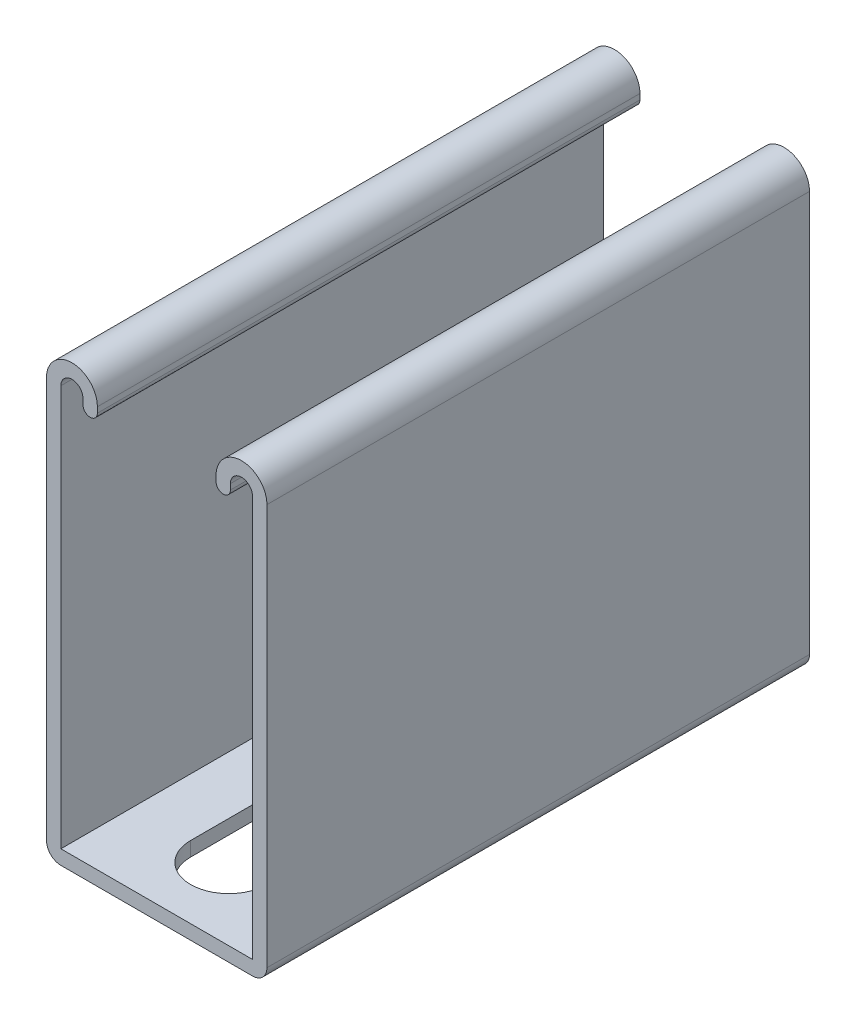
ISO-10303-21;
HEADER;
FILE_DESCRIPTION(('STEP AP214'),'2;1');
FILE_NAME('part.step','',(''),(''),'','','');
FILE_SCHEMA(('AUTOMOTIVE_DESIGN { 1 0 10303 214 1 1 1 1 }'));
ENDSEC;
DATA;
#1=APPLICATION_CONTEXT('core data for automotive mechanical design processes');
#2=APPLICATION_PROTOCOL_DEFINITION('international standard','automotive_design',2000,#1);
#3=PRODUCT_CONTEXT('',#1,'mechanical');
#4=PRODUCT('Part','Part','',(#3));
#5=PRODUCT_RELATED_PRODUCT_CATEGORY('part','',(#4));
#6=PRODUCT_DEFINITION_FORMATION('','',#4);
#7=PRODUCT_DEFINITION_CONTEXT('part definition',#1,'design');
#8=PRODUCT_DEFINITION('design','',#6,#7);
#9=PRODUCT_DEFINITION_SHAPE('','',#8);
#10=(LENGTH_UNIT() NAMED_UNIT(*) SI_UNIT(.MILLI.,.METRE.));
#11=(NAMED_UNIT(*) PLANE_ANGLE_UNIT() SI_UNIT($,.RADIAN.));
#12=(NAMED_UNIT(*) SI_UNIT($,.STERADIAN.) SOLID_ANGLE_UNIT());
#13=UNCERTAINTY_MEASURE_WITH_UNIT(LENGTH_MEASURE(1.E-05),#10,'distance_accuracy_value','');
#14=(GEOMETRIC_REPRESENTATION_CONTEXT(3) GLOBAL_UNCERTAINTY_ASSIGNED_CONTEXT((#13)) GLOBAL_UNIT_ASSIGNED_CONTEXT((#10,
#11,#12)) REPRESENTATION_CONTEXT('',''));
#15=CARTESIAN_POINT('',(0.,0.,0.));
#16=DIRECTION('',(0.,0.,1.));
#17=DIRECTION('',(1.,0.,0.));
#18=AXIS2_PLACEMENT_3D('',#15,#16,#17);
#19=CARTESIAN_POINT('',(-15.875,39.6875,101.6));
#20=DIRECTION('',(0.,0.,-1.));
#21=DIRECTION('',(-1.,0.,0.));
#22=AXIS2_PLACEMENT_3D('',#19,#20,#21);
#23=CYLINDRICAL_SURFACE('',#22,4.7625);
#24=CARTESIAN_POINT('',(-15.875,39.6875,0.));
#25=DIRECTION('',(0.,0.,1.));
#26=DIRECTION('',(-1.,0.,0.));
#27=AXIS2_PLACEMENT_3D('',#24,#25,#26);
#28=CIRCLE('',#27,4.7625);
#29=CARTESIAN_POINT('',(-11.1125,39.6875,0.));
#30=VERTEX_POINT('',#29);
#31=CARTESIAN_POINT('',(-20.6375,39.6875,0.));
#32=VERTEX_POINT('',#31);
#33=EDGE_CURVE('E253',#30,#32,#28,.T.);
#34=ORIENTED_EDGE('',*,*,#33,.T.);
#35=DIRECTION('',(0.,0.,-1.));
#36=VECTOR('',#35,1.);
#37=CARTESIAN_POINT('',(-20.6375,39.6875,101.6));
#38=LINE('',#37,#36);
#39=CARTESIAN_POINT('',(-20.6375,39.6875,101.6));
#40=VERTEX_POINT('',#39);
#41=EDGE_CURVE('E384',#40,#32,#38,.T.);
#42=ORIENTED_EDGE('',*,*,#41,.F.);
#43=CARTESIAN_POINT('',(-15.875,39.6875,101.6));
#44=DIRECTION('',(0.,0.,1.));
#45=DIRECTION('',(-1.,0.,0.));
#46=AXIS2_PLACEMENT_3D('',#43,#44,#45);
#47=CIRCLE('',#46,4.7625);
#48=CARTESIAN_POINT('',(-11.1125,39.6875,101.6));
#49=VERTEX_POINT('',#48);
#50=EDGE_CURVE('E260',#49,#40,#47,.T.);
#51=ORIENTED_EDGE('',*,*,#50,.F.);
#52=DIRECTION('',(0.,0.,-1.));
#53=VECTOR('',#52,1.);
#54=CARTESIAN_POINT('',(-11.1125,39.6875,101.6));
#55=LINE('',#54,#53);
#56=EDGE_CURVE('E298',#49,#30,#55,.T.);
#57=ORIENTED_EDGE('',*,*,#56,.T.);
#58=EDGE_LOOP('',(#34,#42,#51,#57));
#59=FACE_BOUND('',#58,.T.);
#60=ADVANCED_FACE('F32',(#59),#23,.T.);
#61=CARTESIAN_POINT('',(-20.6375,39.6875,101.6));
#62=DIRECTION('',(1.,0.,0.));
#63=DIRECTION('',(0.,1.,0.));
#64=AXIS2_PLACEMENT_3D('',#61,#62,#63);
#65=PLANE('',#64);
#66=DIRECTION('',(0.,-1.,0.));
#67=VECTOR('',#66,1.);
#68=CARTESIAN_POINT('',(-20.6375,39.6875,0.));
#69=LINE('',#68,#67);
#70=CARTESIAN_POINT('',(-20.6375,-35.4076,0.));
#71=VERTEX_POINT('',#70);
#72=EDGE_CURVE('E301',#32,#71,#69,.T.);
#73=ORIENTED_EDGE('',*,*,#72,.T.);
#74=DIRECTION('',(0.,0.,-1.));
#75=VECTOR('',#74,1.);
#76=CARTESIAN_POINT('',(-20.6375,-35.4076,101.6));
#77=LINE('',#76,#75);
#78=CARTESIAN_POINT('',(-20.6375,-35.4076,101.6));
#79=VERTEX_POINT('',#78);
#80=EDGE_CURVE('E381',#79,#71,#77,.T.);
#81=ORIENTED_EDGE('',*,*,#80,.F.);
#82=DIRECTION('',(0.,-1.,0.));
#83=VECTOR('',#82,1.);
#84=CARTESIAN_POINT('',(-20.6375,39.6875,101.6));
#85=LINE('',#84,#83);
#86=EDGE_CURVE('E263',#40,#79,#85,.T.);
#87=ORIENTED_EDGE('',*,*,#86,.F.);
#88=ORIENTED_EDGE('',*,*,#41,.T.);
#89=EDGE_LOOP('',(#73,#81,#87,#88));
#90=FACE_BOUND('',#89,.T.);
#91=ADVANCED_FACE('F425',(#90),#65,.F.);
#92=CARTESIAN_POINT('',(-17.9451,-35.4076,101.6));
#93=DIRECTION('',(0.,0.,-1.));
#94=DIRECTION('',(-1.,0.,0.));
#95=AXIS2_PLACEMENT_3D('',#92,#93,#94);
#96=CYLINDRICAL_SURFACE('',#95,2.6924);
#97=CARTESIAN_POINT('',(-17.9451,-35.4076,0.));
#98=DIRECTION('',(0.,0.,1.));
#99=DIRECTION('',(-1.,0.,0.));
#100=AXIS2_PLACEMENT_3D('',#97,#98,#99);
#101=CIRCLE('',#100,2.6924);
#102=CARTESIAN_POINT('',(-17.9451,-38.1,0.));
#103=VERTEX_POINT('',#102);
#104=EDGE_CURVE('E303',#71,#103,#101,.T.);
#105=ORIENTED_EDGE('',*,*,#104,.T.);
#106=DIRECTION('',(0.,0.,-1.));
#107=VECTOR('',#106,1.);
#108=CARTESIAN_POINT('',(-17.9451,-38.1,101.6));
#109=LINE('',#108,#107);
#110=CARTESIAN_POINT('',(-17.9451,-38.1,101.6));
#111=VERTEX_POINT('',#110);
#112=EDGE_CURVE('E378',#111,#103,#109,.T.);
#113=ORIENTED_EDGE('',*,*,#112,.F.);
#114=CARTESIAN_POINT('',(-17.9451,-35.4076,101.6));
#115=DIRECTION('',(0.,0.,1.));
#116=DIRECTION('',(-1.,0.,0.));
#117=AXIS2_PLACEMENT_3D('',#114,#115,#116);
#118=CIRCLE('',#117,2.6924);
#119=EDGE_CURVE('E266',#79,#111,#118,.T.);
#120=ORIENTED_EDGE('',*,*,#119,.F.);
#121=ORIENTED_EDGE('',*,*,#80,.T.);
#122=EDGE_LOOP('',(#105,#113,#120,#121));
#123=FACE_BOUND('',#122,.T.);
#124=ADVANCED_FACE('F430',(#123),#96,.T.);
#125=CARTESIAN_POINT('',(-17.9451,-38.1,101.6));
#126=DIRECTION('',(0.,1.,0.));
#127=DIRECTION('',(-1.,0.,0.));
#128=AXIS2_PLACEMENT_3D('',#125,#126,#127);
#129=PLANE('',#128);
#130=DIRECTION('',(0.,0.,-1.));
#131=VECTOR('',#130,1.);
#132=CARTESIAN_POINT('',(-7.14375000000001,-38.0999999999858,73.81875));
#133=LINE('',#132,#131);
#134=CARTESIAN_POINT('',(-7.14375000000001,-38.1,88.10625));
#135=VERTEX_POINT('',#134);
#136=CARTESIAN_POINT('',(-7.14375000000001,-38.0999999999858,73.81875));
#137=VERTEX_POINT('',#136);
#138=EDGE_CURVE('E206',#135,#137,#133,.T.);
#139=ORIENTED_EDGE('',*,*,#138,.F.);
#140=CARTESIAN_POINT('',(0.,-38.0999999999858,88.10625));
#141=DIRECTION('',(0.,-1.,0.));
#142=DIRECTION('',(1.,0.,0.));
#143=AXIS2_PLACEMENT_3D('',#140,#141,#142);
#144=CIRCLE('',#143,7.14375);
#145=CARTESIAN_POINT('',(7.14374999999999,-38.0999999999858,88.10625));
#146=VERTEX_POINT('',#145);
#147=EDGE_CURVE('E46',#146,#135,#144,.T.);
#148=ORIENTED_EDGE('',*,*,#147,.F.);
#149=DIRECTION('',(0.,0.,1.));
#150=VECTOR('',#149,1.);
#151=CARTESIAN_POINT('',(7.14374999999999,-38.0999999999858,88.10625));
#152=LINE('',#151,#150);
#153=CARTESIAN_POINT('',(7.14375,-38.0999999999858,73.81875));
#154=VERTEX_POINT('',#153);
#155=EDGE_CURVE('E222',#154,#146,#152,.T.);
#156=ORIENTED_EDGE('',*,*,#155,.F.);
#157=CARTESIAN_POINT('',(0.,-38.0999999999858,73.81875));
#158=DIRECTION('',(0.,-1.,0.));
#159=DIRECTION('',(1.,0.,0.));
#160=AXIS2_PLACEMENT_3D('',#157,#158,#159);
#161=CIRCLE('',#160,7.14375);
#162=EDGE_CURVE('E216',#137,#154,#161,.T.);
#163=ORIENTED_EDGE('',*,*,#162,.F.);
#164=EDGE_LOOP('',(#139,#148,#156,#163));
#165=FACE_BOUND('',#164,.T.);
#166=DIRECTION('',(0.,0.,-1.));
#167=VECTOR('',#166,1.);
#168=CARTESIAN_POINT('',(-7.14375000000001,-38.0999999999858,23.01875));
#169=LINE('',#168,#167);
#170=CARTESIAN_POINT('',(-7.14375000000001,-38.1,37.30625));
#171=VERTEX_POINT('',#170);
#172=CARTESIAN_POINT('',(-7.14375000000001,-38.0999999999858,23.01875));
#173=VERTEX_POINT('',#172);
#174=EDGE_CURVE('E241',#171,#173,#169,.T.);
#175=ORIENTED_EDGE('',*,*,#174,.F.);
#176=CARTESIAN_POINT('',(0.,-38.0999999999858,37.30625));
#177=DIRECTION('',(0.,-1.,0.));
#178=DIRECTION('',(1.,0.,0.));
#179=AXIS2_PLACEMENT_3D('',#176,#177,#178);
#180=CIRCLE('',#179,7.14375);
#181=CARTESIAN_POINT('',(7.14374999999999,-38.0999999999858,37.30625));
#182=VERTEX_POINT('',#181);
#183=EDGE_CURVE('E239',#182,#171,#180,.T.);
#184=ORIENTED_EDGE('',*,*,#183,.F.);
#185=DIRECTION('',(0.,0.,1.));
#186=VECTOR('',#185,1.);
#187=CARTESIAN_POINT('',(7.14374999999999,-38.0999999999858,37.30625));
#188=LINE('',#187,#186);
#189=CARTESIAN_POINT('',(7.14375,-38.0999999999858,23.01875));
#190=VERTEX_POINT('',#189);
#191=EDGE_CURVE('E247',#190,#182,#188,.T.);
#192=ORIENTED_EDGE('',*,*,#191,.F.);
#193=CARTESIAN_POINT('',(0.,-38.0999999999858,23.01875));
#194=DIRECTION('',(0.,-1.,0.));
#195=DIRECTION('',(1.,0.,0.));
#196=AXIS2_PLACEMENT_3D('',#193,#194,#195);
#197=CIRCLE('',#196,7.14375);
#198=EDGE_CURVE('E244',#173,#190,#197,.T.);
#199=ORIENTED_EDGE('',*,*,#198,.F.);
#200=EDGE_LOOP('',(#175,#184,#192,#199));
#201=FACE_BOUND('',#200,.T.);
#202=DIRECTION('',(1.,0.,0.));
#203=VECTOR('',#202,1.);
#204=CARTESIAN_POINT('',(-17.9451,-38.1,0.));
#205=LINE('',#204,#203);
#206=CARTESIAN_POINT('',(17.9451,-38.1,0.));
#207=VERTEX_POINT('',#206);
#208=EDGE_CURVE('E305',#103,#207,#205,.T.);
#209=ORIENTED_EDGE('',*,*,#208,.T.);
#210=DIRECTION('',(0.,0.,-1.));
#211=VECTOR('',#210,1.);
#212=CARTESIAN_POINT('',(17.9451,-38.1,101.6));
#213=LINE('',#212,#211);
#214=CARTESIAN_POINT('',(17.9451,-38.1,101.6));
#215=VERTEX_POINT('',#214);
#216=EDGE_CURVE('E375',#215,#207,#213,.T.);
#217=ORIENTED_EDGE('',*,*,#216,.F.);
#218=DIRECTION('',(1.,0.,0.));
#219=VECTOR('',#218,1.);
#220=CARTESIAN_POINT('',(-17.9451,-38.1,101.6));
#221=LINE('',#220,#219);
#222=EDGE_CURVE('E268',#111,#215,#221,.T.);
#223=ORIENTED_EDGE('',*,*,#222,.F.);
#224=ORIENTED_EDGE('',*,*,#112,.T.);
#225=EDGE_LOOP('',(#209,#217,#223,#224));
#226=FACE_BOUND('',#225,.T.);
#227=ADVANCED_FACE('F220',(#165,#201,#226),#129,.F.);
#228=CARTESIAN_POINT('',(17.9451,-35.4076,101.6));
#229=DIRECTION('',(0.,0.,-1.));
#230=DIRECTION('',(-1.,0.,0.));
#231=AXIS2_PLACEMENT_3D('',#228,#229,#230);
#232=CYLINDRICAL_SURFACE('',#231,2.6924);
#233=CARTESIAN_POINT('',(17.9451,-35.4076,0.));
#234=DIRECTION('',(0.,0.,1.));
#235=DIRECTION('',(1.,0.,0.));
#236=AXIS2_PLACEMENT_3D('',#233,#234,#235);
#237=CIRCLE('',#236,2.6924);
#238=CARTESIAN_POINT('',(20.6375,-35.4076,0.));
#239=VERTEX_POINT('',#238);
#240=EDGE_CURVE('E307',#207,#239,#237,.T.);
#241=ORIENTED_EDGE('',*,*,#240,.T.);
#242=DIRECTION('',(0.,0.,-1.));
#243=VECTOR('',#242,1.);
#244=CARTESIAN_POINT('',(20.6375,-35.4076,101.6));
#245=LINE('',#244,#243);
#246=CARTESIAN_POINT('',(20.6375,-35.4076,101.6));
#247=VERTEX_POINT('',#246);
#248=EDGE_CURVE('E372',#247,#239,#245,.T.);
#249=ORIENTED_EDGE('',*,*,#248,.F.);
#250=CARTESIAN_POINT('',(17.9451,-35.4076,101.6));
#251=DIRECTION('',(0.,0.,1.));
#252=DIRECTION('',(1.,0.,0.));
#253=AXIS2_PLACEMENT_3D('',#250,#251,#252);
#254=CIRCLE('',#253,2.6924);
#255=EDGE_CURVE('E270',#215,#247,#254,.T.);
#256=ORIENTED_EDGE('',*,*,#255,.F.);
#257=ORIENTED_EDGE('',*,*,#216,.T.);
#258=EDGE_LOOP('',(#241,#249,#256,#257));
#259=FACE_BOUND('',#258,.T.);
#260=ADVANCED_FACE('F510',(#259),#232,.T.);
#261=CARTESIAN_POINT('',(20.6375,-35.4076,101.6));
#262=DIRECTION('',(-1.,0.,0.));
#263=DIRECTION('',(0.,-1.,0.));
#264=AXIS2_PLACEMENT_3D('',#261,#262,#263);
#265=PLANE('',#264);
#266=DIRECTION('',(0.,1.,0.));
#267=VECTOR('',#266,1.);
#268=CARTESIAN_POINT('',(20.6375,-35.4076,0.));
#269=LINE('',#268,#267);
#270=CARTESIAN_POINT('',(20.6375,39.6875,0.));
#271=VERTEX_POINT('',#270);
#272=EDGE_CURVE('E309',#239,#271,#269,.T.);
#273=ORIENTED_EDGE('',*,*,#272,.T.);
#274=DIRECTION('',(0.,0.,-1.));
#275=VECTOR('',#274,1.);
#276=CARTESIAN_POINT('',(20.6375,39.6875,101.6));
#277=LINE('',#276,#275);
#278=CARTESIAN_POINT('',(20.6375,39.6875,101.6));
#279=VERTEX_POINT('',#278);
#280=EDGE_CURVE('E369',#279,#271,#277,.T.);
#281=ORIENTED_EDGE('',*,*,#280,.F.);
#282=DIRECTION('',(0.,1.,0.));
#283=VECTOR('',#282,1.);
#284=CARTESIAN_POINT('',(20.6375,-35.4076,101.6));
#285=LINE('',#284,#283);
#286=EDGE_CURVE('E272',#247,#279,#285,.T.);
#287=ORIENTED_EDGE('',*,*,#286,.F.);
#288=ORIENTED_EDGE('',*,*,#248,.T.);
#289=EDGE_LOOP('',(#273,#281,#287,#288));
#290=FACE_BOUND('',#289,.T.);
#291=ADVANCED_FACE('F506',(#290),#265,.F.);
#292=CARTESIAN_POINT('',(15.875,39.6875,101.6));
#293=DIRECTION('',(0.,0.,-1.));
#294=DIRECTION('',(-1.,0.,0.));
#295=AXIS2_PLACEMENT_3D('',#292,#293,#294);
#296=CYLINDRICAL_SURFACE('',#295,4.7625);
#297=CARTESIAN_POINT('',(15.875,39.6875,0.));
#298=DIRECTION('',(0.,0.,1.));
#299=DIRECTION('',(1.,0.,0.));
#300=AXIS2_PLACEMENT_3D('',#297,#298,#299);
#301=CIRCLE('',#300,4.7625);
#302=CARTESIAN_POINT('',(11.1125,39.6875,0.));
#303=VERTEX_POINT('',#302);
#304=EDGE_CURVE('E311',#271,#303,#301,.T.);
#305=ORIENTED_EDGE('',*,*,#304,.T.);
#306=DIRECTION('',(0.,0.,-1.));
#307=VECTOR('',#306,1.);
#308=CARTESIAN_POINT('',(11.1125,39.6875,101.6));
#309=LINE('',#308,#307);
#310=CARTESIAN_POINT('',(11.1125,39.6875,101.6));
#311=VERTEX_POINT('',#310);
#312=EDGE_CURVE('E366',#311,#303,#309,.T.);
#313=ORIENTED_EDGE('',*,*,#312,.F.);
#314=CARTESIAN_POINT('',(15.875,39.6875,101.6));
#315=DIRECTION('',(0.,0.,1.));
#316=DIRECTION('',(1.,0.,0.));
#317=AXIS2_PLACEMENT_3D('',#314,#315,#316);
#318=CIRCLE('',#317,4.7625);
#319=EDGE_CURVE('E274',#279,#311,#318,.T.);
#320=ORIENTED_EDGE('',*,*,#319,.F.);
#321=ORIENTED_EDGE('',*,*,#280,.T.);
#322=EDGE_LOOP('',(#305,#313,#320,#321));
#323=FACE_BOUND('',#322,.T.);
#324=ADVANCED_FACE('F501',(#323),#296,.T.);
#325=CARTESIAN_POINT('',(11.1125,39.6875,101.6));
#326=DIRECTION('',(1.,0.,0.));
#327=DIRECTION('',(0.,1.,0.));
#328=AXIS2_PLACEMENT_3D('',#325,#326,#327);
#329=PLANE('',#328);
#330=DIRECTION('',(0.,-1.,0.));
#331=VECTOR('',#330,1.);
#332=CARTESIAN_POINT('',(11.1125,39.6875,0.));
#333=LINE('',#332,#331);
#334=CARTESIAN_POINT('',(11.1125,38.65245,0.));
#335=VERTEX_POINT('',#334);
#336=EDGE_CURVE('E313',#303,#335,#333,.T.);
#337=ORIENTED_EDGE('',*,*,#336,.T.);
#338=DIRECTION('',(0.,0.,-1.));
#339=VECTOR('',#338,1.);
#340=CARTESIAN_POINT('',(11.1125,38.65245,101.6));
#341=LINE('',#340,#339);
#342=CARTESIAN_POINT('',(11.1125,38.65245,101.6));
#343=VERTEX_POINT('',#342);
#344=EDGE_CURVE('E363',#343,#335,#341,.T.);
#345=ORIENTED_EDGE('',*,*,#344,.F.);
#346=DIRECTION('',(0.,-1.,0.));
#347=VECTOR('',#346,1.);
#348=CARTESIAN_POINT('',(11.1125,39.6875,101.6));
#349=LINE('',#348,#347);
#350=EDGE_CURVE('E276',#311,#343,#349,.T.);
#351=ORIENTED_EDGE('',*,*,#350,.F.);
#352=ORIENTED_EDGE('',*,*,#312,.T.);
#353=EDGE_LOOP('',(#337,#345,#351,#352));
#354=FACE_BOUND('',#353,.T.);
#355=ADVANCED_FACE('F495',(#354),#329,.F.);
#356=CARTESIAN_POINT('',(12.4587,38.65245,101.6));
#357=DIRECTION('',(0.,0.,-1.));
#358=DIRECTION('',(-1.,0.,0.));
#359=AXIS2_PLACEMENT_3D('',#356,#357,#358);
#360=CYLINDRICAL_SURFACE('',#359,1.3462);
#361=CARTESIAN_POINT('',(12.4587,38.65245,0.));
#362=DIRECTION('',(0.,0.,1.));
#363=DIRECTION('',(1.,0.,0.));
#364=AXIS2_PLACEMENT_3D('',#361,#362,#363);
#365=CIRCLE('',#364,1.3462);
#366=CARTESIAN_POINT('',(13.8049,38.65245,0.));
#367=VERTEX_POINT('',#366);
#368=EDGE_CURVE('E315',#335,#367,#365,.T.);
#369=ORIENTED_EDGE('',*,*,#368,.T.);
#370=DIRECTION('',(0.,0.,-1.));
#371=VECTOR('',#370,1.);
#372=CARTESIAN_POINT('',(13.8049,38.65245,101.6));
#373=LINE('',#372,#371);
#374=CARTESIAN_POINT('',(13.8049,38.65245,101.6));
#375=VERTEX_POINT('',#374);
#376=EDGE_CURVE('E360',#375,#367,#373,.T.);
#377=ORIENTED_EDGE('',*,*,#376,.F.);
#378=CARTESIAN_POINT('',(12.4587,38.65245,101.6));
#379=DIRECTION('',(0.,0.,1.));
#380=DIRECTION('',(1.,0.,0.));
#381=AXIS2_PLACEMENT_3D('',#378,#379,#380);
#382=CIRCLE('',#381,1.3462);
#383=EDGE_CURVE('E278',#343,#375,#382,.T.);
#384=ORIENTED_EDGE('',*,*,#383,.F.);
#385=ORIENTED_EDGE('',*,*,#344,.T.);
#386=EDGE_LOOP('',(#369,#377,#384,#385));
#387=FACE_BOUND('',#386,.T.);
#388=ADVANCED_FACE('F491',(#387),#360,.T.);
#389=CARTESIAN_POINT('',(13.8049,39.6875,101.6));
#390=DIRECTION('',(-1.,0.,0.));
#391=DIRECTION('',(0.,0.,1.));
#392=AXIS2_PLACEMENT_3D('',#389,#390,#391);
#393=PLANE('',#392);
#394=DIRECTION('',(0.,1.,0.));
#395=VECTOR('',#394,1.);
#396=CARTESIAN_POINT('',(13.8049,39.6875,0.));
#397=LINE('',#396,#395);
#398=CARTESIAN_POINT('',(13.8049,39.6875,0.));
#399=VERTEX_POINT('',#398);
#400=EDGE_CURVE('E317',#367,#399,#397,.T.);
#401=ORIENTED_EDGE('',*,*,#400,.T.);
#402=DIRECTION('',(0.,0.,-1.));
#403=VECTOR('',#402,1.);
#404=CARTESIAN_POINT('',(13.8049,39.6875,101.6));
#405=LINE('',#404,#403);
#406=CARTESIAN_POINT('',(13.8049,39.6875,101.6));
#407=VERTEX_POINT('',#406);
#408=EDGE_CURVE('E357',#407,#399,#405,.T.);
#409=ORIENTED_EDGE('',*,*,#408,.F.);
#410=DIRECTION('',(0.,1.,0.));
#411=VECTOR('',#410,1.);
#412=CARTESIAN_POINT('',(13.8049,39.6875,101.6));
#413=LINE('',#412,#411);
#414=EDGE_CURVE('E280',#375,#407,#413,.T.);
#415=ORIENTED_EDGE('',*,*,#414,.F.);
#416=ORIENTED_EDGE('',*,*,#376,.T.);
#417=EDGE_LOOP('',(#401,#409,#415,#416));
#418=FACE_BOUND('',#417,.T.);
#419=ADVANCED_FACE('F486',(#418),#393,.F.);
#420=CARTESIAN_POINT('',(15.875,39.6875,101.6));
#421=DIRECTION('',(0.,0.,-1.));
#422=DIRECTION('',(-1.,0.,0.));
#423=AXIS2_PLACEMENT_3D('',#420,#421,#422);
#424=CYLINDRICAL_SURFACE('',#423,2.07010000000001);
#425=CARTESIAN_POINT('',(15.875,39.6875,0.));
#426=DIRECTION('',(0.,0.,-1.));
#427=DIRECTION('',(1.,0.,0.));
#428=AXIS2_PLACEMENT_3D('',#425,#426,#427);
#429=CIRCLE('',#428,2.07010000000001);
#430=CARTESIAN_POINT('',(17.9451,39.6875,0.));
#431=VERTEX_POINT('',#430);
#432=EDGE_CURVE('E319',#399,#431,#429,.T.);
#433=ORIENTED_EDGE('',*,*,#432,.T.);
#434=DIRECTION('',(0.,0.,-1.));
#435=VECTOR('',#434,1.);
#436=CARTESIAN_POINT('',(17.9451,39.6875,101.6));
#437=LINE('',#436,#435);
#438=CARTESIAN_POINT('',(17.9451,39.6875,101.6));
#439=VERTEX_POINT('',#438);
#440=EDGE_CURVE('E354',#439,#431,#437,.T.);
#441=ORIENTED_EDGE('',*,*,#440,.F.);
#442=CARTESIAN_POINT('',(15.875,39.6875,101.6));
#443=DIRECTION('',(0.,0.,-1.));
#444=DIRECTION('',(1.,0.,0.));
#445=AXIS2_PLACEMENT_3D('',#442,#443,#444);
#446=CIRCLE('',#445,2.07010000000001);
#447=EDGE_CURVE('E282',#407,#439,#446,.T.);
#448=ORIENTED_EDGE('',*,*,#447,.F.);
#449=ORIENTED_EDGE('',*,*,#408,.T.);
#450=EDGE_LOOP('',(#433,#441,#448,#449));
#451=FACE_BOUND('',#450,.T.);
#452=ADVANCED_FACE('F480',(#451),#424,.F.);
#453=CARTESIAN_POINT('',(17.9451,-35.4076,101.6));
#454=DIRECTION('',(1.,0.,0.));
#455=DIRECTION('',(0.,0.,-1.));
#456=AXIS2_PLACEMENT_3D('',#453,#454,#455);
#457=PLANE('',#456);
#458=DIRECTION('',(0.,-1.,0.));
#459=VECTOR('',#458,1.);
#460=CARTESIAN_POINT('',(17.9451,-35.4076,0.));
#461=LINE('',#460,#459);
#462=CARTESIAN_POINT('',(17.9451,-35.4076,0.));
#463=VERTEX_POINT('',#462);
#464=EDGE_CURVE('E321',#431,#463,#461,.T.);
#465=ORIENTED_EDGE('',*,*,#464,.T.);
#466=DIRECTION('',(0.,0.,-1.));
#467=VECTOR('',#466,1.);
#468=CARTESIAN_POINT('',(17.9451,-35.4076,101.6));
#469=LINE('',#468,#467);
#470=CARTESIAN_POINT('',(17.9451,-35.4076,101.6));
#471=VERTEX_POINT('',#470);
#472=EDGE_CURVE('E351',#471,#463,#469,.T.);
#473=ORIENTED_EDGE('',*,*,#472,.F.);
#474=DIRECTION('',(0.,-1.,0.));
#475=VECTOR('',#474,1.);
#476=CARTESIAN_POINT('',(17.9451,-35.4076,101.6));
#477=LINE('',#476,#475);
#478=EDGE_CURVE('E284',#439,#471,#477,.T.);
#479=ORIENTED_EDGE('',*,*,#478,.F.);
#480=ORIENTED_EDGE('',*,*,#440,.T.);
#481=EDGE_LOOP('',(#465,#473,#479,#480));
#482=FACE_BOUND('',#481,.T.);
#483=ADVANCED_FACE('F476',(#482),#457,.F.);
#484=CARTESIAN_POINT('',(-17.9451,-35.4076,101.6));
#485=DIRECTION('',(0.,-1.,0.));
#486=DIRECTION('',(0.,0.,-1.));
#487=AXIS2_PLACEMENT_3D('',#484,#485,#486);
#488=PLANE('',#487);
#489=DIRECTION('',(0.,0.,1.));
#490=VECTOR('',#489,1.);
#491=CARTESIAN_POINT('',(7.14374999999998,-35.4076,152.4));
#492=LINE('',#491,#490);
#493=CARTESIAN_POINT('',(7.14375,-35.4076,73.81875));
#494=VERTEX_POINT('',#493);
#495=CARTESIAN_POINT('',(7.14374999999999,-35.4076,88.10625));
#496=VERTEX_POINT('',#495);
#497=EDGE_CURVE('E232',#494,#496,#492,.T.);
#498=ORIENTED_EDGE('',*,*,#497,.T.);
#499=CARTESIAN_POINT('',(0.,-35.4076,88.10625));
#500=DIRECTION('',(0.,-1.,0.));
#501=DIRECTION('',(0.,0.,-1.));
#502=AXIS2_PLACEMENT_3D('',#499,#500,#501);
#503=CIRCLE('',#502,7.14375);
#504=CARTESIAN_POINT('',(-7.14375000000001,-35.4076,88.10625));
#505=VERTEX_POINT('',#504);
#506=EDGE_CURVE('E236',#496,#505,#503,.T.);
#507=ORIENTED_EDGE('',*,*,#506,.T.);
#508=DIRECTION('',(0.,0.,-1.));
#509=VECTOR('',#508,1.);
#510=CARTESIAN_POINT('',(-7.14375000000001,-35.4076,152.4));
#511=LINE('',#510,#509);
#512=CARTESIAN_POINT('',(-7.14375000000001,-35.4076,73.81875));
#513=VERTEX_POINT('',#512);
#514=EDGE_CURVE('E213',#505,#513,#511,.T.);
#515=ORIENTED_EDGE('',*,*,#514,.T.);
#516=CARTESIAN_POINT('',(0.,-35.4076,73.81875));
#517=DIRECTION('',(0.,-1.,0.));
#518=DIRECTION('',(0.,0.,-1.));
#519=AXIS2_PLACEMENT_3D('',#516,#517,#518);
#520=CIRCLE('',#519,7.14375);
#521=EDGE_CURVE('E54',#513,#494,#520,.T.);
#522=ORIENTED_EDGE('',*,*,#521,.T.);
#523=EDGE_LOOP('',(#498,#507,#515,#522));
#524=FACE_BOUND('',#523,.T.);
#525=DIRECTION('',(0.,0.,1.));
#526=VECTOR('',#525,1.);
#527=CARTESIAN_POINT('',(7.14374999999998,-35.4076,101.6));
#528=LINE('',#527,#526);
#529=CARTESIAN_POINT('',(7.14375,-35.4076,23.01875));
#530=VERTEX_POINT('',#529);
#531=CARTESIAN_POINT('',(7.14374999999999,-35.4076,37.30625));
#532=VERTEX_POINT('',#531);
#533=EDGE_CURVE('E39',#530,#532,#528,.T.);
#534=ORIENTED_EDGE('',*,*,#533,.T.);
#535=CARTESIAN_POINT('',(0.,-35.4076,37.30625));
#536=DIRECTION('',(0.,-1.,0.));
#537=DIRECTION('',(0.,0.,-1.));
#538=AXIS2_PLACEMENT_3D('',#535,#536,#537);
#539=CIRCLE('',#538,7.14375);
#540=CARTESIAN_POINT('',(-7.14375000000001,-35.4076,37.30625));
#541=VERTEX_POINT('',#540);
#542=EDGE_CURVE('E11',#532,#541,#539,.T.);
#543=ORIENTED_EDGE('',*,*,#542,.T.);
#544=DIRECTION('',(0.,0.,-1.));
#545=VECTOR('',#544,1.);
#546=CARTESIAN_POINT('',(-7.14375000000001,-35.4076,101.6));
#547=LINE('',#546,#545);
#548=CARTESIAN_POINT('',(-7.14375000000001,-35.4076,23.01875));
#549=VERTEX_POINT('',#548);
#550=EDGE_CURVE('E387',#541,#549,#547,.T.);
#551=ORIENTED_EDGE('',*,*,#550,.T.);
#552=CARTESIAN_POINT('',(0.,-35.4076,23.01875));
#553=DIRECTION('',(0.,-1.,0.));
#554=DIRECTION('',(0.,0.,-1.));
#555=AXIS2_PLACEMENT_3D('',#552,#553,#554);
#556=CIRCLE('',#555,7.14375);
#557=EDGE_CURVE('E390',#549,#530,#556,.T.);
#558=ORIENTED_EDGE('',*,*,#557,.T.);
#559=EDGE_LOOP('',(#534,#543,#551,#558));
#560=FACE_BOUND('',#559,.T.);
#561=DIRECTION('',(-1.,0.,0.));
#562=VECTOR('',#561,1.);
#563=CARTESIAN_POINT('',(-17.9451,-35.4076,0.));
#564=LINE('',#563,#562);
#565=CARTESIAN_POINT('',(-17.9451,-35.4076,0.));
#566=VERTEX_POINT('',#565);
#567=EDGE_CURVE('E323',#463,#566,#564,.T.);
#568=ORIENTED_EDGE('',*,*,#567,.T.);
#569=DIRECTION('',(0.,0.,-1.));
#570=VECTOR('',#569,1.);
#571=CARTESIAN_POINT('',(-17.9451,-35.4076,101.6));
#572=LINE('',#571,#570);
#573=CARTESIAN_POINT('',(-17.9451,-35.4076,101.6));
#574=VERTEX_POINT('',#573);
#575=EDGE_CURVE('E348',#574,#566,#572,.T.);
#576=ORIENTED_EDGE('',*,*,#575,.F.);
#577=DIRECTION('',(-1.,0.,0.));
#578=VECTOR('',#577,1.);
#579=CARTESIAN_POINT('',(-17.9451,-35.4076,101.6));
#580=LINE('',#579,#578);
#581=EDGE_CURVE('E286',#471,#574,#580,.T.);
#582=ORIENTED_EDGE('',*,*,#581,.F.);
#583=ORIENTED_EDGE('',*,*,#472,.T.);
#584=EDGE_LOOP('',(#568,#576,#582,#583));
#585=FACE_BOUND('',#584,.T.);
#586=ADVANCED_FACE('F394',(#524,#560,#585),#488,.F.);
#587=CARTESIAN_POINT('',(-17.9451,39.6875,101.6));
#588=DIRECTION('',(-1.,0.,0.));
#589=DIRECTION('',(0.,-1.,0.));
#590=AXIS2_PLACEMENT_3D('',#587,#588,#589);
#591=PLANE('',#590);
#592=DIRECTION('',(0.,1.,0.));
#593=VECTOR('',#592,1.);
#594=CARTESIAN_POINT('',(-17.9451,39.6875,0.));
#595=LINE('',#594,#593);
#596=CARTESIAN_POINT('',(-17.9451,39.6875,0.));
#597=VERTEX_POINT('',#596);
#598=EDGE_CURVE('E325',#566,#597,#595,.T.);
#599=ORIENTED_EDGE('',*,*,#598,.T.);
#600=DIRECTION('',(0.,0.,-1.));
#601=VECTOR('',#600,1.);
#602=CARTESIAN_POINT('',(-17.9451,39.6875,101.6));
#603=LINE('',#602,#601);
#604=CARTESIAN_POINT('',(-17.9451,39.6875,101.6));
#605=VERTEX_POINT('',#604);
#606=EDGE_CURVE('E345',#605,#597,#603,.T.);
#607=ORIENTED_EDGE('',*,*,#606,.F.);
#608=DIRECTION('',(0.,1.,0.));
#609=VECTOR('',#608,1.);
#610=CARTESIAN_POINT('',(-17.9451,39.6875,101.6));
#611=LINE('',#610,#609);
#612=EDGE_CURVE('E288',#574,#605,#611,.T.);
#613=ORIENTED_EDGE('',*,*,#612,.F.);
#614=ORIENTED_EDGE('',*,*,#575,.T.);
#615=EDGE_LOOP('',(#599,#607,#613,#614));
#616=FACE_BOUND('',#615,.T.);
#617=ADVANCED_FACE('F467',(#616),#591,.F.);
#618=CARTESIAN_POINT('',(-15.875,39.6875,101.6));
#619=DIRECTION('',(0.,0.,-1.));
#620=DIRECTION('',(-1.,0.,0.));
#621=AXIS2_PLACEMENT_3D('',#618,#619,#620);
#622=CYLINDRICAL_SURFACE('',#621,2.0701);
#623=CARTESIAN_POINT('',(-15.875,39.6875,0.));
#624=DIRECTION('',(0.,0.,-1.));
#625=DIRECTION('',(-1.,0.,0.));
#626=AXIS2_PLACEMENT_3D('',#623,#624,#625);
#627=CIRCLE('',#626,2.0701);
#628=CARTESIAN_POINT('',(-13.8049,39.6875,0.));
#629=VERTEX_POINT('',#628);
#630=EDGE_CURVE('E327',#597,#629,#627,.T.);
#631=ORIENTED_EDGE('',*,*,#630,.T.);
#632=DIRECTION('',(0.,0.,-1.));
#633=VECTOR('',#632,1.);
#634=CARTESIAN_POINT('',(-13.8049,39.6875,101.6));
#635=LINE('',#634,#633);
#636=CARTESIAN_POINT('',(-13.8049,39.6875,101.6));
#637=VERTEX_POINT('',#636);
#638=EDGE_CURVE('E342',#637,#629,#635,.T.);
#639=ORIENTED_EDGE('',*,*,#638,.F.);
#640=CARTESIAN_POINT('',(-15.875,39.6875,101.6));
#641=DIRECTION('',(0.,0.,-1.));
#642=DIRECTION('',(-1.,0.,0.));
#643=AXIS2_PLACEMENT_3D('',#640,#641,#642);
#644=CIRCLE('',#643,2.0701);
#645=EDGE_CURVE('E290',#605,#637,#644,.T.);
#646=ORIENTED_EDGE('',*,*,#645,.F.);
#647=ORIENTED_EDGE('',*,*,#606,.T.);
#648=EDGE_LOOP('',(#631,#639,#646,#647));
#649=FACE_BOUND('',#648,.T.);
#650=ADVANCED_FACE('F463',(#649),#622,.F.);
#651=CARTESIAN_POINT('',(-13.8049,39.6875,101.6));
#652=DIRECTION('',(1.,0.,0.));
#653=DIRECTION('',(0.,1.,0.));
#654=AXIS2_PLACEMENT_3D('',#651,#652,#653);
#655=PLANE('',#654);
#656=DIRECTION('',(0.,-1.,0.));
#657=VECTOR('',#656,1.);
#658=CARTESIAN_POINT('',(-13.8049,39.6875,0.));
#659=LINE('',#658,#657);
#660=CARTESIAN_POINT('',(-13.8049,38.65245,0.));
#661=VERTEX_POINT('',#660);
#662=EDGE_CURVE('E329',#629,#661,#659,.T.);
#663=ORIENTED_EDGE('',*,*,#662,.T.);
#664=DIRECTION('',(0.,0.,-1.));
#665=VECTOR('',#664,1.);
#666=CARTESIAN_POINT('',(-13.8049,38.65245,101.6));
#667=LINE('',#666,#665);
#668=CARTESIAN_POINT('',(-13.8049,38.65245,101.6));
#669=VERTEX_POINT('',#668);
#670=EDGE_CURVE('E339',#669,#661,#667,.T.);
#671=ORIENTED_EDGE('',*,*,#670,.F.);
#672=DIRECTION('',(0.,-1.,0.));
#673=VECTOR('',#672,1.);
#674=CARTESIAN_POINT('',(-13.8049,39.6875,101.6));
#675=LINE('',#674,#673);
#676=EDGE_CURVE('E292',#637,#669,#675,.T.);
#677=ORIENTED_EDGE('',*,*,#676,.F.);
#678=ORIENTED_EDGE('',*,*,#638,.T.);
#679=EDGE_LOOP('',(#663,#671,#677,#678));
#680=FACE_BOUND('',#679,.T.);
#681=ADVANCED_FACE('F458',(#680),#655,.F.);
#682=CARTESIAN_POINT('',(-12.4587,38.65245,101.6));
#683=DIRECTION('',(0.,0.,-1.));
#684=DIRECTION('',(-1.,0.,0.));
#685=AXIS2_PLACEMENT_3D('',#682,#683,#684);
#686=CYLINDRICAL_SURFACE('',#685,1.3462);
#687=CARTESIAN_POINT('',(-12.4587,38.65245,0.));
#688=DIRECTION('',(0.,0.,1.));
#689=DIRECTION('',(-1.,0.,0.));
#690=AXIS2_PLACEMENT_3D('',#687,#688,#689);
#691=CIRCLE('',#690,1.3462);
#692=CARTESIAN_POINT('',(-11.1125,38.65245,0.));
#693=VERTEX_POINT('',#692);
#694=EDGE_CURVE('E331',#661,#693,#691,.T.);
#695=ORIENTED_EDGE('',*,*,#694,.T.);
#696=DIRECTION('',(0.,0.,-1.));
#697=VECTOR('',#696,1.);
#698=CARTESIAN_POINT('',(-11.1125,38.65245,101.6));
#699=LINE('',#698,#697);
#700=CARTESIAN_POINT('',(-11.1125,38.65245,101.6));
#701=VERTEX_POINT('',#700);
#702=EDGE_CURVE('E336',#701,#693,#699,.T.);
#703=ORIENTED_EDGE('',*,*,#702,.F.);
#704=CARTESIAN_POINT('',(-12.4587,38.65245,101.6));
#705=DIRECTION('',(0.,0.,1.));
#706=DIRECTION('',(-1.,0.,0.));
#707=AXIS2_PLACEMENT_3D('',#704,#705,#706);
#708=CIRCLE('',#707,1.3462);
#709=EDGE_CURVE('E294',#669,#701,#708,.T.);
#710=ORIENTED_EDGE('',*,*,#709,.F.);
#711=ORIENTED_EDGE('',*,*,#670,.T.);
#712=EDGE_LOOP('',(#695,#703,#710,#711));
#713=FACE_BOUND('',#712,.T.);
#714=ADVANCED_FACE('F452',(#713),#686,.T.);
#715=CARTESIAN_POINT('',(-11.1125,39.6875,101.6));
#716=DIRECTION('',(-1.,0.,0.));
#717=DIRECTION('',(0.,-1.,0.));
#718=AXIS2_PLACEMENT_3D('',#715,#716,#717);
#719=PLANE('',#718);
#720=DIRECTION('',(0.,1.,0.));
#721=VECTOR('',#720,1.);
#722=CARTESIAN_POINT('',(-11.1125,39.6875,0.));
#723=LINE('',#722,#721);
#724=EDGE_CURVE('E264',#693,#30,#723,.T.);
#725=ORIENTED_EDGE('',*,*,#724,.T.);
#726=ORIENTED_EDGE('',*,*,#56,.F.);
#727=DIRECTION('',(0.,1.,0.));
#728=VECTOR('',#727,1.);
#729=CARTESIAN_POINT('',(-11.1125,39.6875,101.6));
#730=LINE('',#729,#728);
#731=EDGE_CURVE('E296',#701,#49,#730,.T.);
#732=ORIENTED_EDGE('',*,*,#731,.F.);
#733=ORIENTED_EDGE('',*,*,#702,.T.);
#734=EDGE_LOOP('',(#725,#726,#732,#733));
#735=FACE_BOUND('',#734,.T.);
#736=ADVANCED_FACE('F450',(#735),#719,.F.);
#737=CARTESIAN_POINT('',(-15.875,39.6875,101.6));
#738=DIRECTION('',(0.,0.,-1.));
#739=DIRECTION('',(-1.,0.,0.));
#740=AXIS2_PLACEMENT_3D('',#737,#738,#739);
#741=PLANE('',#740);
#742=ORIENTED_EDGE('',*,*,#50,.T.);
#743=ORIENTED_EDGE('',*,*,#86,.T.);
#744=ORIENTED_EDGE('',*,*,#119,.T.);
#745=ORIENTED_EDGE('',*,*,#222,.T.);
#746=ORIENTED_EDGE('',*,*,#255,.T.);
#747=ORIENTED_EDGE('',*,*,#286,.T.);
#748=ORIENTED_EDGE('',*,*,#319,.T.);
#749=ORIENTED_EDGE('',*,*,#350,.T.);
#750=ORIENTED_EDGE('',*,*,#383,.T.);
#751=ORIENTED_EDGE('',*,*,#414,.T.);
#752=ORIENTED_EDGE('',*,*,#447,.T.);
#753=ORIENTED_EDGE('',*,*,#478,.T.);
#754=ORIENTED_EDGE('',*,*,#581,.T.);
#755=ORIENTED_EDGE('',*,*,#612,.T.);
#756=ORIENTED_EDGE('',*,*,#645,.T.);
#757=ORIENTED_EDGE('',*,*,#676,.T.);
#758=ORIENTED_EDGE('',*,*,#709,.T.);
#759=ORIENTED_EDGE('',*,*,#731,.T.);
#760=EDGE_LOOP('',(#742,#743,#744,#745,#746,#747,#748,#749,#750,#751,#752,#753,#754,#755,#756,
#757,#758,#759));
#761=FACE_BOUND('',#760,.T.);
#762=ADVANCED_FACE('F445',(#761),#741,.F.);
#763=CARTESIAN_POINT('',(-15.875,39.6875,0.));
#764=DIRECTION('',(0.,0.,-1.));
#765=DIRECTION('',(-1.,0.,0.));
#766=AXIS2_PLACEMENT_3D('',#763,#764,#765);
#767=PLANE('',#766);
#768=ORIENTED_EDGE('',*,*,#33,.F.);
#769=ORIENTED_EDGE('',*,*,#724,.F.);
#770=ORIENTED_EDGE('',*,*,#694,.F.);
#771=ORIENTED_EDGE('',*,*,#662,.F.);
#772=ORIENTED_EDGE('',*,*,#630,.F.);
#773=ORIENTED_EDGE('',*,*,#598,.F.);
#774=ORIENTED_EDGE('',*,*,#567,.F.);
#775=ORIENTED_EDGE('',*,*,#464,.F.);
#776=ORIENTED_EDGE('',*,*,#432,.F.);
#777=ORIENTED_EDGE('',*,*,#400,.F.);
#778=ORIENTED_EDGE('',*,*,#368,.F.);
#779=ORIENTED_EDGE('',*,*,#336,.F.);
#780=ORIENTED_EDGE('',*,*,#304,.F.);
#781=ORIENTED_EDGE('',*,*,#272,.F.);
#782=ORIENTED_EDGE('',*,*,#240,.F.);
#783=ORIENTED_EDGE('',*,*,#208,.F.);
#784=ORIENTED_EDGE('',*,*,#104,.F.);
#785=ORIENTED_EDGE('',*,*,#72,.F.);
#786=EDGE_LOOP('',(#768,#769,#770,#771,#772,#773,#774,#775,#776,#777,#778,#779,#780,#781,#782,
#783,#784,#785));
#787=FACE_BOUND('',#786,.T.);
#788=ADVANCED_FACE('F438',(#787),#767,.T.);
#789=CARTESIAN_POINT('',(0.,44.45,37.30625));
#790=DIRECTION('',(0.,-1.,0.));
#791=DIRECTION('',(1.,0.,0.));
#792=AXIS2_PLACEMENT_3D('',#789,#790,#791);
#793=CYLINDRICAL_SURFACE('',#792,7.14375);
#794=DIRECTION('',(0.,-1.,0.));
#795=VECTOR('',#794,1.);
#796=CARTESIAN_POINT('',(7.14375000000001,44.45,37.30625));
#797=LINE('',#796,#795);
#798=EDGE_CURVE('E251',#532,#182,#797,.T.);
#799=ORIENTED_EDGE('',*,*,#798,.T.);
#800=ORIENTED_EDGE('',*,*,#183,.T.);
#801=DIRECTION('',(0.,-1.,0.));
#802=VECTOR('',#801,1.);
#803=CARTESIAN_POINT('',(-7.14374999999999,44.45,37.30625));
#804=LINE('',#803,#802);
#805=EDGE_CURVE('E250',#541,#171,#804,.T.);
#806=ORIENTED_EDGE('',*,*,#805,.F.);
#807=ORIENTED_EDGE('',*,*,#542,.F.);
#808=EDGE_LOOP('',(#799,#800,#806,#807));
#809=FACE_BOUND('',#808,.T.);
#810=ADVANCED_FACE('F410',(#809),#793,.F.);
#811=CARTESIAN_POINT('',(7.14375000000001,44.45,37.30625));
#812=DIRECTION('',(1.,0.,0.));
#813=DIRECTION('',(0.,0.,-1.));
#814=AXIS2_PLACEMENT_3D('',#811,#812,#813);
#815=PLANE('',#814);
#816=DIRECTION('',(0.,-1.,0.));
#817=VECTOR('',#816,1.);
#818=CARTESIAN_POINT('',(7.14375000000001,44.45,23.01875));
#819=LINE('',#818,#817);
#820=EDGE_CURVE('E254',#530,#190,#819,.T.);
#821=ORIENTED_EDGE('',*,*,#820,.T.);
#822=ORIENTED_EDGE('',*,*,#191,.T.);
#823=ORIENTED_EDGE('',*,*,#798,.F.);
#824=ORIENTED_EDGE('',*,*,#533,.F.);
#825=EDGE_LOOP('',(#821,#822,#823,#824));
#826=FACE_BOUND('',#825,.T.);
#827=ADVANCED_FACE('F400',(#826),#815,.F.);
#828=CARTESIAN_POINT('',(0.,44.45,23.01875));
#829=DIRECTION('',(0.,-1.,0.));
#830=DIRECTION('',(1.,0.,0.));
#831=AXIS2_PLACEMENT_3D('',#828,#829,#830);
#832=CYLINDRICAL_SURFACE('',#831,7.14375);
#833=DIRECTION('',(0.,-1.,0.));
#834=VECTOR('',#833,1.);
#835=CARTESIAN_POINT('',(-7.14374999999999,44.45,23.01875));
#836=LINE('',#835,#834);
#837=EDGE_CURVE('E256',#549,#173,#836,.T.);
#838=ORIENTED_EDGE('',*,*,#837,.T.);
#839=ORIENTED_EDGE('',*,*,#198,.T.);
#840=ORIENTED_EDGE('',*,*,#820,.F.);
#841=ORIENTED_EDGE('',*,*,#557,.F.);
#842=EDGE_LOOP('',(#838,#839,#840,#841));
#843=FACE_BOUND('',#842,.T.);
#844=ADVANCED_FACE('F402',(#843),#832,.F.);
#845=CARTESIAN_POINT('',(-7.14374999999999,44.45,23.01875));
#846=DIRECTION('',(-1.,0.,0.));
#847=DIRECTION('',(0.,-1.,0.));
#848=AXIS2_PLACEMENT_3D('',#845,#846,#847);
#849=PLANE('',#848);
#850=ORIENTED_EDGE('',*,*,#805,.T.);
#851=ORIENTED_EDGE('',*,*,#174,.T.);
#852=ORIENTED_EDGE('',*,*,#837,.F.);
#853=ORIENTED_EDGE('',*,*,#550,.F.);
#854=EDGE_LOOP('',(#850,#851,#852,#853));
#855=FACE_BOUND('',#854,.T.);
#856=ADVANCED_FACE('F412',(#855),#849,.F.);
#857=CARTESIAN_POINT('',(0.,44.45,88.10625));
#858=DIRECTION('',(0.,-1.,0.));
#859=DIRECTION('',(1.,0.,0.));
#860=AXIS2_PLACEMENT_3D('',#857,#858,#859);
#861=CYLINDRICAL_SURFACE('',#860,7.14375);
#862=DIRECTION('',(0.,-1.,0.));
#863=VECTOR('',#862,1.);
#864=CARTESIAN_POINT('',(7.14375000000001,44.45,88.10625));
#865=LINE('',#864,#863);
#866=EDGE_CURVE('E230',#496,#146,#865,.T.);
#867=ORIENTED_EDGE('',*,*,#866,.T.);
#868=ORIENTED_EDGE('',*,*,#147,.T.);
#869=DIRECTION('',(0.,-1.,0.));
#870=VECTOR('',#869,1.);
#871=CARTESIAN_POINT('',(-7.14374999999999,44.45,88.10625));
#872=LINE('',#871,#870);
#873=EDGE_CURVE('E210',#505,#135,#872,.T.);
#874=ORIENTED_EDGE('',*,*,#873,.F.);
#875=ORIENTED_EDGE('',*,*,#506,.F.);
#876=EDGE_LOOP('',(#867,#868,#874,#875));
#877=FACE_BOUND('',#876,.T.);
#878=ADVANCED_FACE('F414',(#877),#861,.F.);
#879=CARTESIAN_POINT('',(7.14375000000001,44.45,88.10625));
#880=DIRECTION('',(1.,0.,0.));
#881=DIRECTION('',(0.,0.,-1.));
#882=AXIS2_PLACEMENT_3D('',#879,#880,#881);
#883=PLANE('',#882);
#884=DIRECTION('',(0.,-1.,0.));
#885=VECTOR('',#884,1.);
#886=CARTESIAN_POINT('',(7.14375000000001,44.45,73.81875));
#887=LINE('',#886,#885);
#888=EDGE_CURVE('E223',#494,#154,#887,.T.);
#889=ORIENTED_EDGE('',*,*,#888,.T.);
#890=ORIENTED_EDGE('',*,*,#155,.T.);
#891=ORIENTED_EDGE('',*,*,#866,.F.);
#892=ORIENTED_EDGE('',*,*,#497,.F.);
#893=EDGE_LOOP('',(#889,#890,#891,#892));
#894=FACE_BOUND('',#893,.T.);
#895=ADVANCED_FACE('F420',(#894),#883,.F.);
#896=CARTESIAN_POINT('',(0.,44.45,73.81875));
#897=DIRECTION('',(0.,-1.,0.));
#898=DIRECTION('',(1.,0.,0.));
#899=AXIS2_PLACEMENT_3D('',#896,#897,#898);
#900=CYLINDRICAL_SURFACE('',#899,7.14375);
#901=DIRECTION('',(0.,-1.,0.));
#902=VECTOR('',#901,1.);
#903=CARTESIAN_POINT('',(-7.14374999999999,44.45,73.81875));
#904=LINE('',#903,#902);
#905=EDGE_CURVE('E208',#513,#137,#904,.T.);
#906=ORIENTED_EDGE('',*,*,#905,.T.);
#907=ORIENTED_EDGE('',*,*,#162,.T.);
#908=ORIENTED_EDGE('',*,*,#888,.F.);
#909=ORIENTED_EDGE('',*,*,#521,.F.);
#910=EDGE_LOOP('',(#906,#907,#908,#909));
#911=FACE_BOUND('',#910,.T.);
#912=ADVANCED_FACE('F215',(#911),#900,.F.);
#913=CARTESIAN_POINT('',(-7.14374999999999,44.45,73.81875));
#914=DIRECTION('',(-1.,0.,0.));
#915=DIRECTION('',(0.,-1.,0.));
#916=AXIS2_PLACEMENT_3D('',#913,#914,#915);
#917=PLANE('',#916);
#918=ORIENTED_EDGE('',*,*,#873,.T.);
#919=ORIENTED_EDGE('',*,*,#138,.T.);
#920=ORIENTED_EDGE('',*,*,#905,.F.);
#921=ORIENTED_EDGE('',*,*,#514,.F.);
#922=EDGE_LOOP('',(#918,#919,#920,#921));
#923=FACE_BOUND('',#922,.T.);
#924=ADVANCED_FACE('F207',(#923),#917,.F.);
#925=CLOSED_SHELL('',(#60,#91,#124,#227,#260,#291,#324,#355,#388,#419,#452,#483,#586,#617,#650,
#681,#714,#736,#762,#788,#810,#827,#844,#856,#878,#895,#912,#924));
#926=MANIFOLD_SOLID_BREP('B2',#925);
#927=ADVANCED_BREP_SHAPE_REPRESENTATION('',(#18,#926),#14);
#928=SHAPE_DEFINITION_REPRESENTATION(#9,#927);
ENDSEC;
END-ISO-10303-21;
